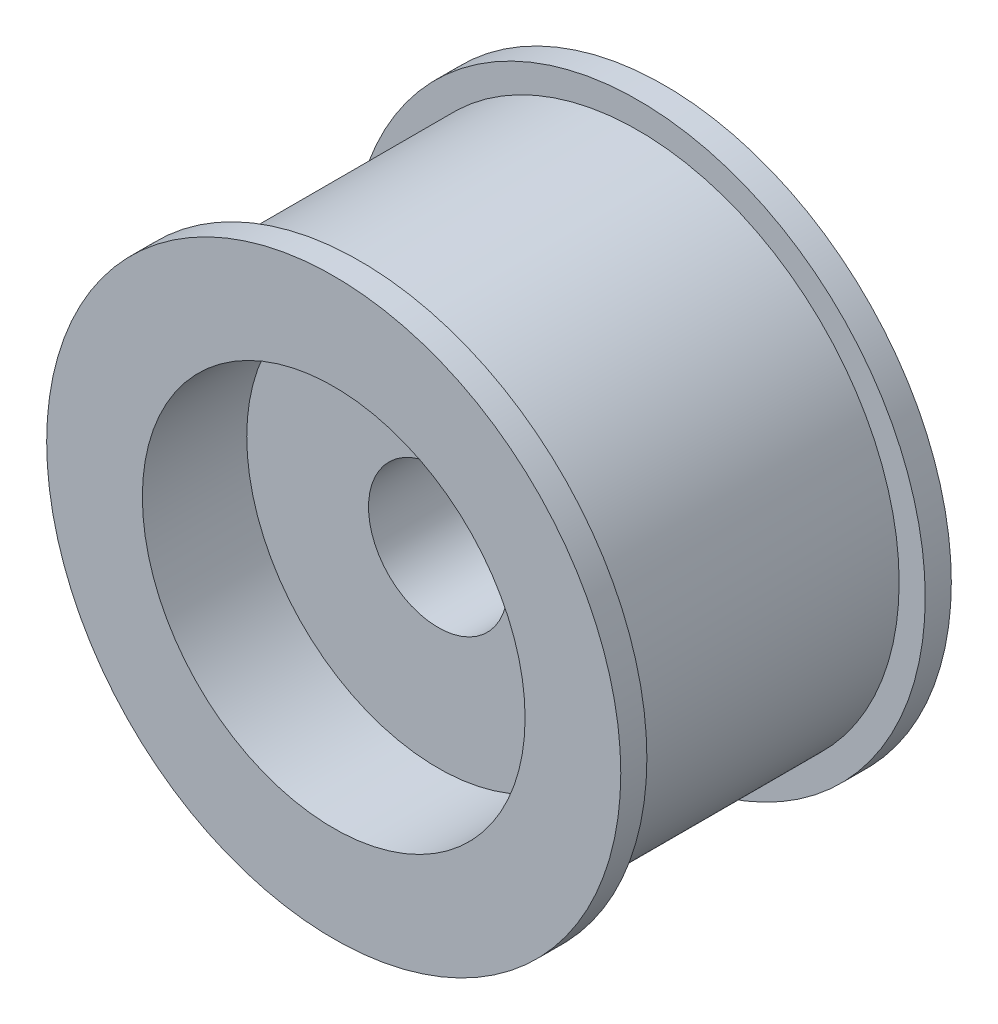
ISO-10303-21;
HEADER;
FILE_DESCRIPTION(('STEP AP214'),'2;1');
FILE_NAME('part.step','',(''),(''),'','','');
FILE_SCHEMA(('AUTOMOTIVE_DESIGN { 1 0 10303 214 1 1 1 1 }'));
ENDSEC;
DATA;
#1=APPLICATION_CONTEXT('core data for automotive mechanical design processes');
#2=APPLICATION_PROTOCOL_DEFINITION('international standard','automotive_design',2000,#1);
#3=PRODUCT_CONTEXT('',#1,'mechanical');
#4=PRODUCT('Part','Part','',(#3));
#5=PRODUCT_RELATED_PRODUCT_CATEGORY('part','',(#4));
#6=PRODUCT_DEFINITION_FORMATION('','',#4);
#7=PRODUCT_DEFINITION_CONTEXT('part definition',#1,'design');
#8=PRODUCT_DEFINITION('design','',#6,#7);
#9=PRODUCT_DEFINITION_SHAPE('','',#8);
#10=(LENGTH_UNIT() NAMED_UNIT(*) SI_UNIT(.MILLI.,.METRE.));
#11=(NAMED_UNIT(*) PLANE_ANGLE_UNIT() SI_UNIT($,.RADIAN.));
#12=(NAMED_UNIT(*) SI_UNIT($,.STERADIAN.) SOLID_ANGLE_UNIT());
#13=UNCERTAINTY_MEASURE_WITH_UNIT(LENGTH_MEASURE(1.E-05),#10,'distance_accuracy_value','');
#14=(GEOMETRIC_REPRESENTATION_CONTEXT(3) GLOBAL_UNCERTAINTY_ASSIGNED_CONTEXT((#13)) GLOBAL_UNIT_ASSIGNED_CONTEXT((#10,
#11,#12)) REPRESENTATION_CONTEXT('',''));
#15=CARTESIAN_POINT('',(0.,0.,0.));
#16=DIRECTION('',(0.,0.,1.));
#17=DIRECTION('',(1.,0.,0.));
#18=AXIS2_PLACEMENT_3D('',#15,#16,#17);
#19=CARTESIAN_POINT('',(0.,0.,20.8646380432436));
#20=DIRECTION('',(0.,0.,1.));
#21=DIRECTION('',(1.,0.,0.));
#22=AXIS2_PLACEMENT_3D('',#19,#20,#21);
#23=CYLINDRICAL_SURFACE('',#22,9.);
#24=CARTESIAN_POINT('',(0.,0.,-9.5));
#25=DIRECTION('',(0.,0.,1.));
#26=DIRECTION('',(1.,0.,0.));
#27=AXIS2_PLACEMENT_3D('',#24,#25,#26);
#28=CIRCLE('',#27,9.);
#29=CARTESIAN_POINT('',(9.,0.,-9.5));
#30=VERTEX_POINT('',#29);
#31=EDGE_CURVE('E52',#30,#30,#28,.T.);
#32=ORIENTED_EDGE('',*,*,#31,.F.);
#33=EDGE_LOOP('',(#32));
#34=FACE_BOUND('',#33,.T.);
#35=CARTESIAN_POINT('',(0.,0.,-3.5));
#36=DIRECTION('',(0.,0.,1.));
#37=DIRECTION('',(1.,0.,0.));
#38=AXIS2_PLACEMENT_3D('',#35,#36,#37);
#39=CIRCLE('',#38,9.);
#40=CARTESIAN_POINT('',(9.,0.,-3.5));
#41=VERTEX_POINT('',#40);
#42=EDGE_CURVE('E8',#41,#41,#39,.T.);
#43=ORIENTED_EDGE('',*,*,#42,.T.);
#44=EDGE_LOOP('',(#43));
#45=FACE_BOUND('',#44,.T.);
#46=ADVANCED_FACE('F12',(#34,#45),#23,.F.);
#47=CARTESIAN_POINT('',(0.,4.,-3.5));
#48=DIRECTION('',(0.,0.,1.));
#49=DIRECTION('',(1.,0.,0.));
#50=AXIS2_PLACEMENT_3D('',#47,#48,#49);
#51=PLANE('',#50);
#52=ORIENTED_EDGE('',*,*,#42,.F.);
#53=EDGE_LOOP('',(#52));
#54=FACE_BOUND('',#53,.T.);
#55=CARTESIAN_POINT('',(0.,0.,-3.5));
#56=DIRECTION('',(0.,0.,1.));
#57=DIRECTION('',(1.,0.,0.));
#58=AXIS2_PLACEMENT_3D('',#55,#56,#57);
#59=CIRCLE('',#58,4.);
#60=CARTESIAN_POINT('',(4.,0.,-3.5));
#61=VERTEX_POINT('',#60);
#62=EDGE_CURVE('E18',#61,#61,#59,.T.);
#63=ORIENTED_EDGE('',*,*,#62,.T.);
#64=EDGE_LOOP('',(#63));
#65=FACE_BOUND('',#64,.T.);
#66=ADVANCED_FACE('F59',(#54,#65),#51,.F.);
#67=CARTESIAN_POINT('',(0.,0.,20.8646380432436));
#68=DIRECTION('',(0.,0.,1.));
#69=DIRECTION('',(1.,0.,0.));
#70=AXIS2_PLACEMENT_3D('',#67,#68,#69);
#71=CYLINDRICAL_SURFACE('',#70,4.);
#72=ORIENTED_EDGE('',*,*,#62,.F.);
#73=EDGE_LOOP('',(#72));
#74=FACE_BOUND('',#73,.T.);
#75=CARTESIAN_POINT('',(0.,0.,3.5));
#76=DIRECTION('',(0.,0.,1.));
#77=DIRECTION('',(1.,0.,0.));
#78=AXIS2_PLACEMENT_3D('',#75,#76,#77);
#79=CIRCLE('',#78,4.);
#80=CARTESIAN_POINT('',(4.,0.,3.5));
#81=VERTEX_POINT('',#80);
#82=EDGE_CURVE('E22',#81,#81,#79,.T.);
#83=ORIENTED_EDGE('',*,*,#82,.T.);
#84=EDGE_LOOP('',(#83));
#85=FACE_BOUND('',#84,.T.);
#86=ADVANCED_FACE('F65',(#74,#85),#71,.F.);
#87=CARTESIAN_POINT('',(0.,11.,3.5));
#88=DIRECTION('',(0.,0.,-1.));
#89=DIRECTION('',(-1.,0.,0.));
#90=AXIS2_PLACEMENT_3D('',#87,#88,#89);
#91=PLANE('',#90);
#92=ORIENTED_EDGE('',*,*,#82,.F.);
#93=EDGE_LOOP('',(#92));
#94=FACE_BOUND('',#93,.T.);
#95=CARTESIAN_POINT('',(0.,0.,3.5));
#96=DIRECTION('',(0.,0.,1.));
#97=DIRECTION('',(1.,0.,0.));
#98=AXIS2_PLACEMENT_3D('',#95,#96,#97);
#99=CIRCLE('',#98,11.);
#100=CARTESIAN_POINT('',(11.,0.,3.5));
#101=VERTEX_POINT('',#100);
#102=EDGE_CURVE('E26',#101,#101,#99,.T.);
#103=ORIENTED_EDGE('',*,*,#102,.T.);
#104=EDGE_LOOP('',(#103));
#105=FACE_BOUND('',#104,.T.);
#106=ADVANCED_FACE('F71',(#94,#105),#91,.F.);
#107=CARTESIAN_POINT('',(0.,0.,20.8646380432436));
#108=DIRECTION('',(0.,0.,1.));
#109=DIRECTION('',(1.,0.,0.));
#110=AXIS2_PLACEMENT_3D('',#107,#108,#109);
#111=CYLINDRICAL_SURFACE('',#110,11.);
#112=ORIENTED_EDGE('',*,*,#102,.F.);
#113=EDGE_LOOP('',(#112));
#114=FACE_BOUND('',#113,.T.);
#115=CARTESIAN_POINT('',(0.,0.,9.5));
#116=DIRECTION('',(0.,0.,1.));
#117=DIRECTION('',(1.,0.,0.));
#118=AXIS2_PLACEMENT_3D('',#115,#116,#117);
#119=CIRCLE('',#118,11.);
#120=CARTESIAN_POINT('',(11.,0.,9.5));
#121=VERTEX_POINT('',#120);
#122=EDGE_CURVE('E31',#121,#121,#119,.T.);
#123=ORIENTED_EDGE('',*,*,#122,.T.);
#124=EDGE_LOOP('',(#123));
#125=FACE_BOUND('',#124,.T.);
#126=ADVANCED_FACE('F77',(#114,#125),#111,.F.);
#127=CARTESIAN_POINT('',(0.,16.5,9.5));
#128=DIRECTION('',(0.,0.,-1.));
#129=DIRECTION('',(-1.,0.,0.));
#130=AXIS2_PLACEMENT_3D('',#127,#128,#129);
#131=PLANE('',#130);
#132=ORIENTED_EDGE('',*,*,#122,.F.);
#133=EDGE_LOOP('',(#132));
#134=FACE_BOUND('',#133,.T.);
#135=CARTESIAN_POINT('',(0.,0.,9.5));
#136=DIRECTION('',(0.,0.,1.));
#137=DIRECTION('',(1.,0.,0.));
#138=AXIS2_PLACEMENT_3D('',#135,#136,#137);
#139=CIRCLE('',#138,16.5);
#140=CARTESIAN_POINT('',(16.5,0.,9.5));
#141=VERTEX_POINT('',#140);
#142=EDGE_CURVE('E34',#141,#141,#139,.T.);
#143=ORIENTED_EDGE('',*,*,#142,.T.);
#144=EDGE_LOOP('',(#143));
#145=FACE_BOUND('',#144,.T.);
#146=ADVANCED_FACE('F81',(#134,#145),#131,.F.);
#147=CARTESIAN_POINT('',(0.,0.,20.8646380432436));
#148=DIRECTION('',(0.,0.,1.));
#149=DIRECTION('',(1.,0.,0.));
#150=AXIS2_PLACEMENT_3D('',#147,#148,#149);
#151=CYLINDRICAL_SURFACE('',#150,16.5);
#152=ORIENTED_EDGE('',*,*,#142,.F.);
#153=EDGE_LOOP('',(#152));
#154=FACE_BOUND('',#153,.T.);
#155=CARTESIAN_POINT('',(0.,0.,8.));
#156=DIRECTION('',(0.,0.,1.));
#157=DIRECTION('',(1.,0.,0.));
#158=AXIS2_PLACEMENT_3D('',#155,#156,#157);
#159=CIRCLE('',#158,16.5);
#160=CARTESIAN_POINT('',(16.5,0.,8.));
#161=VERTEX_POINT('',#160);
#162=EDGE_CURVE('E37',#161,#161,#159,.T.);
#163=ORIENTED_EDGE('',*,*,#162,.T.);
#164=EDGE_LOOP('',(#163));
#165=FACE_BOUND('',#164,.T.);
#166=ADVANCED_FACE('F85',(#154,#165),#151,.T.);
#167=CARTESIAN_POINT('',(0.,15.,8.));
#168=DIRECTION('',(0.,0.,1.));
#169=DIRECTION('',(1.,0.,0.));
#170=AXIS2_PLACEMENT_3D('',#167,#168,#169);
#171=PLANE('',#170);
#172=ORIENTED_EDGE('',*,*,#162,.F.);
#173=EDGE_LOOP('',(#172));
#174=FACE_BOUND('',#173,.T.);
#175=CARTESIAN_POINT('',(0.,0.,8.));
#176=DIRECTION('',(0.,0.,1.));
#177=DIRECTION('',(1.,0.,0.));
#178=AXIS2_PLACEMENT_3D('',#175,#176,#177);
#179=CIRCLE('',#178,15.);
#180=CARTESIAN_POINT('',(15.,0.,8.));
#181=VERTEX_POINT('',#180);
#182=EDGE_CURVE('E40',#181,#181,#179,.T.);
#183=ORIENTED_EDGE('',*,*,#182,.T.);
#184=EDGE_LOOP('',(#183));
#185=FACE_BOUND('',#184,.T.);
#186=ADVANCED_FACE('F89',(#174,#185),#171,.F.);
#187=CARTESIAN_POINT('',(0.,0.,20.8646380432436));
#188=DIRECTION('',(0.,0.,1.));
#189=DIRECTION('',(1.,0.,0.));
#190=AXIS2_PLACEMENT_3D('',#187,#188,#189);
#191=CYLINDRICAL_SURFACE('',#190,15.);
#192=ORIENTED_EDGE('',*,*,#182,.F.);
#193=EDGE_LOOP('',(#192));
#194=FACE_BOUND('',#193,.T.);
#195=CARTESIAN_POINT('',(0.,0.,-8.));
#196=DIRECTION('',(0.,0.,1.));
#197=DIRECTION('',(1.,0.,0.));
#198=AXIS2_PLACEMENT_3D('',#195,#196,#197);
#199=CIRCLE('',#198,15.);
#200=CARTESIAN_POINT('',(15.,0.,-8.));
#201=VERTEX_POINT('',#200);
#202=EDGE_CURVE('E43',#201,#201,#199,.T.);
#203=ORIENTED_EDGE('',*,*,#202,.T.);
#204=EDGE_LOOP('',(#203));
#205=FACE_BOUND('',#204,.T.);
#206=ADVANCED_FACE('F93',(#194,#205),#191,.T.);
#207=CARTESIAN_POINT('',(0.,16.5,-8.));
#208=DIRECTION('',(0.,0.,-1.));
#209=DIRECTION('',(-1.,0.,0.));
#210=AXIS2_PLACEMENT_3D('',#207,#208,#209);
#211=PLANE('',#210);
#212=ORIENTED_EDGE('',*,*,#202,.F.);
#213=EDGE_LOOP('',(#212));
#214=FACE_BOUND('',#213,.T.);
#215=CARTESIAN_POINT('',(0.,0.,-8.));
#216=DIRECTION('',(0.,0.,1.));
#217=DIRECTION('',(1.,0.,0.));
#218=AXIS2_PLACEMENT_3D('',#215,#216,#217);
#219=CIRCLE('',#218,16.5);
#220=CARTESIAN_POINT('',(16.5,0.,-8.));
#221=VERTEX_POINT('',#220);
#222=EDGE_CURVE('E46',#221,#221,#219,.T.);
#223=ORIENTED_EDGE('',*,*,#222,.T.);
#224=EDGE_LOOP('',(#223));
#225=FACE_BOUND('',#224,.T.);
#226=ADVANCED_FACE('F97',(#214,#225),#211,.F.);
#227=CARTESIAN_POINT('',(0.,0.,20.8646380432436));
#228=DIRECTION('',(0.,0.,1.));
#229=DIRECTION('',(1.,0.,0.));
#230=AXIS2_PLACEMENT_3D('',#227,#228,#229);
#231=CYLINDRICAL_SURFACE('',#230,16.5);
#232=ORIENTED_EDGE('',*,*,#222,.F.);
#233=EDGE_LOOP('',(#232));
#234=FACE_BOUND('',#233,.T.);
#235=CARTESIAN_POINT('',(0.,0.,-9.5));
#236=DIRECTION('',(0.,0.,1.));
#237=DIRECTION('',(1.,0.,0.));
#238=AXIS2_PLACEMENT_3D('',#235,#236,#237);
#239=CIRCLE('',#238,16.5);
#240=CARTESIAN_POINT('',(16.5,0.,-9.5));
#241=VERTEX_POINT('',#240);
#242=EDGE_CURVE('E49',#241,#241,#239,.T.);
#243=ORIENTED_EDGE('',*,*,#242,.T.);
#244=EDGE_LOOP('',(#243));
#245=FACE_BOUND('',#244,.T.);
#246=ADVANCED_FACE('F101',(#234,#245),#231,.T.);
#247=CARTESIAN_POINT('',(0.,9.,-9.5));
#248=DIRECTION('',(0.,0.,1.));
#249=DIRECTION('',(1.,0.,0.));
#250=AXIS2_PLACEMENT_3D('',#247,#248,#249);
#251=PLANE('',#250);
#252=ORIENTED_EDGE('',*,*,#242,.F.);
#253=EDGE_LOOP('',(#252));
#254=FACE_BOUND('',#253,.T.);
#255=ORIENTED_EDGE('',*,*,#31,.T.);
#256=EDGE_LOOP('',(#255));
#257=FACE_BOUND('',#256,.T.);
#258=ADVANCED_FACE('F56',(#254,#257),#251,.F.);
#259=CLOSED_SHELL('',(#46,#66,#86,#106,#126,#146,#166,#186,#206,#226,#246,#258));
#260=MANIFOLD_SOLID_BREP('B1',#259);
#261=ADVANCED_BREP_SHAPE_REPRESENTATION('',(#18,#260),#14);
#262=SHAPE_DEFINITION_REPRESENTATION(#9,#261);
ENDSEC;
END-ISO-10303-21;
